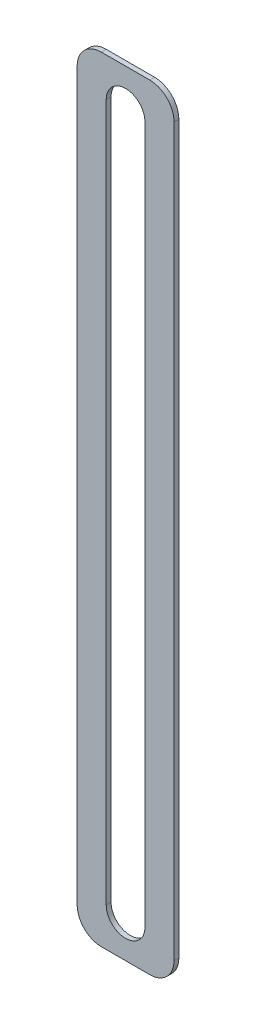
from build123d import *

# Parameters (mm, degrees)
EXTRUDE_1_DEPTH = 0.5


with BuildPart() as part:
    # Sketch 2 → Extrude 1 (new body)
    with BuildSketch(Plane.XY):
        with BuildLine():
            Line((2.5, 40), (-2.5, 40))
            ThreePointArc((-2.5, 40), (-4.267766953, 39.267766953), (-5, 37.5))
            Line((-5, 37.5), (-5, -37.5))
            ThreePointArc((-5, -37.5), (-4.267766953, -39.267766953), (-2.5, -40))
            Line((-2.5, -40), (2.5, -40))
            ThreePointArc((2.5, -40), (4.267766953, -39.267766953), (5, -37.5))
            Line((5, -37.5), (5, 37.5))
            ThreePointArc((5, 37.5), (4.267766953, 39.267766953), (2.5, 40))
        make_face()
        with BuildLine():
            Line((-2, -36), (-2, 36))
            ThreePointArc((-2, 36), (0, 38), (2, 36))
            Line((2, 36), (2, -36))
            ThreePointArc((2, -36), (0, -38), (-2, -36))
        make_face(mode=Mode.SUBTRACT)
    extrude(amount=EXTRUDE_1_DEPTH)


solid = part.part
